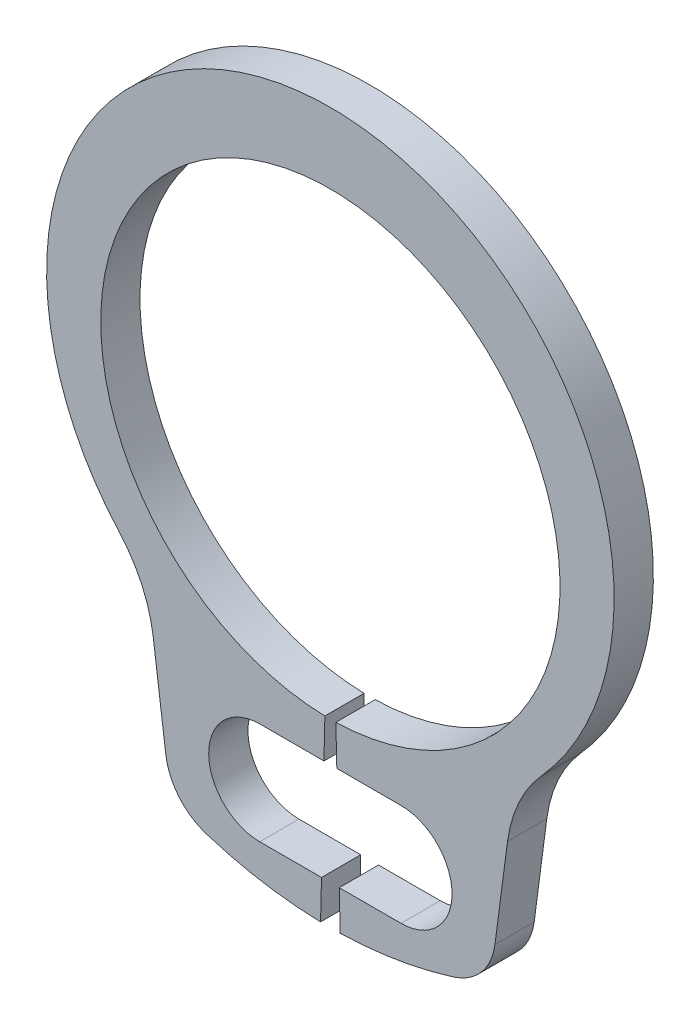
ISO-10303-21;
HEADER;
FILE_DESCRIPTION(('STEP AP214'),'2;1');
FILE_NAME('part.step','',(''),(''),'','','');
FILE_SCHEMA(('AUTOMOTIVE_DESIGN { 1 0 10303 214 1 1 1 1 }'));
ENDSEC;
DATA;
#1=APPLICATION_CONTEXT('core data for automotive mechanical design processes');
#2=APPLICATION_PROTOCOL_DEFINITION('international standard','automotive_design',2000,#1);
#3=PRODUCT_CONTEXT('',#1,'mechanical');
#4=PRODUCT('Part','Part','',(#3));
#5=PRODUCT_RELATED_PRODUCT_CATEGORY('part','',(#4));
#6=PRODUCT_DEFINITION_FORMATION('','',#4);
#7=PRODUCT_DEFINITION_CONTEXT('part definition',#1,'design');
#8=PRODUCT_DEFINITION('design','',#6,#7);
#9=PRODUCT_DEFINITION_SHAPE('','',#8);
#10=(LENGTH_UNIT() NAMED_UNIT(*) SI_UNIT(.MILLI.,.METRE.));
#11=(NAMED_UNIT(*) PLANE_ANGLE_UNIT() SI_UNIT($,.RADIAN.));
#12=(NAMED_UNIT(*) SI_UNIT($,.STERADIAN.) SOLID_ANGLE_UNIT());
#13=UNCERTAINTY_MEASURE_WITH_UNIT(LENGTH_MEASURE(1.E-05),#10,'distance_accuracy_value','');
#14=(GEOMETRIC_REPRESENTATION_CONTEXT(3) GLOBAL_UNCERTAINTY_ASSIGNED_CONTEXT((#13)) GLOBAL_UNIT_ASSIGNED_CONTEXT((#10,
#11,#12)) REPRESENTATION_CONTEXT('',''));
#15=CARTESIAN_POINT('',(0.,0.,0.));
#16=DIRECTION('',(0.,0.,1.));
#17=DIRECTION('',(1.,0.,0.));
#18=AXIS2_PLACEMENT_3D('',#15,#16,#17);
#19=CARTESIAN_POINT('',(-0.0355478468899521,-1.4854747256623,-0.254));
#20=DIRECTION('',(0.999713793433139,-0.0239234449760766,0.));
#21=DIRECTION('',(0.0239234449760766,0.999713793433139,0.));
#22=AXIS2_PLACEMENT_3D('',#19,#20,#21);
#23=PLANE('',#22);
#24=DIRECTION('',(0.,0.,1.));
#25=VECTOR('',#24,1.);
#26=CARTESIAN_POINT('',(-0.041658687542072,-1.74083475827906,-0.254));
#27=LINE('',#26,#25);
#28=CARTESIAN_POINT('',(-0.0416586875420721,-1.74083475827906,-0.254));
#29=VERTEX_POINT('',#28);
#30=CARTESIAN_POINT('',(-0.0416586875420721,-1.74083475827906,0.));
#31=VERTEX_POINT('',#30);
#32=EDGE_CURVE('E203',#29,#31,#27,.T.);
#33=ORIENTED_EDGE('',*,*,#32,.F.);
#34=DIRECTION('',(0.0239234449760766,0.999713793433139,0.));
#35=VECTOR('',#34,1.);
#36=CARTESIAN_POINT('',(-0.0355478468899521,-1.4854747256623,-0.254));
#37=LINE('',#36,#35);
#38=CARTESIAN_POINT('',(-0.0355478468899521,-1.4854747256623,-0.254));
#39=VERTEX_POINT('',#38);
#40=EDGE_CURVE('E192',#29,#39,#37,.T.);
#41=ORIENTED_EDGE('',*,*,#40,.T.);
#42=DIRECTION('',(0.,0.,1.));
#43=VECTOR('',#42,1.);
#44=CARTESIAN_POINT('',(-0.0355478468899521,-1.4854747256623,-0.254));
#45=LINE('',#44,#43);
#46=CARTESIAN_POINT('',(-0.0355478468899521,-1.4854747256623,0.));
#47=VERTEX_POINT('',#46);
#48=EDGE_CURVE('E11',#39,#47,#45,.T.);
#49=ORIENTED_EDGE('',*,*,#48,.T.);
#50=DIRECTION('',(0.0239234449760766,0.999713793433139,0.));
#51=VECTOR('',#50,1.);
#52=CARTESIAN_POINT('',(-0.0355478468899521,-1.4854747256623,0.));
#53=LINE('',#52,#51);
#54=EDGE_CURVE('E281',#31,#47,#53,.T.);
#55=ORIENTED_EDGE('',*,*,#54,.F.);
#56=EDGE_LOOP('',(#33,#41,#49,#55));
#57=FACE_BOUND('',#56,.T.);
#58=ADVANCED_FACE('F32',(#57),#23,.T.);
#59=CARTESIAN_POINT('',(0.0355478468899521,-1.4854747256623,-0.254));
#60=DIRECTION('',(-0.999713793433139,-0.0239234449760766,0.));
#61=DIRECTION('',(0.0239234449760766,-0.999713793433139,0.));
#62=AXIS2_PLACEMENT_3D('',#59,#60,#61);
#63=PLANE('',#62);
#64=DIRECTION('',(0.,0.,-1.));
#65=VECTOR('',#64,1.);
#66=CARTESIAN_POINT('',(0.041658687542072,-1.74083475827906,-0.254));
#67=LINE('',#66,#65);
#68=CARTESIAN_POINT('',(0.0416586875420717,-1.74083475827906,0.));
#69=VERTEX_POINT('',#68);
#70=CARTESIAN_POINT('',(0.0416586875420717,-1.74083475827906,-0.254));
#71=VERTEX_POINT('',#70);
#72=EDGE_CURVE('E314',#69,#71,#67,.T.);
#73=ORIENTED_EDGE('',*,*,#72,.F.);
#74=DIRECTION('',(0.0239234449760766,-0.999713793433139,0.));
#75=VECTOR('',#74,1.);
#76=CARTESIAN_POINT('',(0.0355478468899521,-1.4854747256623,0.));
#77=LINE('',#76,#75);
#78=CARTESIAN_POINT('',(0.0355478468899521,-1.4854747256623,0.));
#79=VERTEX_POINT('',#78);
#80=EDGE_CURVE('E251',#79,#69,#77,.T.);
#81=ORIENTED_EDGE('',*,*,#80,.F.);
#82=DIRECTION('',(0.,0.,1.));
#83=VECTOR('',#82,1.);
#84=CARTESIAN_POINT('',(0.0355478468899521,-1.4854747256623,-0.254));
#85=LINE('',#84,#83);
#86=CARTESIAN_POINT('',(0.0355478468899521,-1.4854747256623,-0.254));
#87=VERTEX_POINT('',#86);
#88=EDGE_CURVE('E36',#87,#79,#85,.T.);
#89=ORIENTED_EDGE('',*,*,#88,.F.);
#90=DIRECTION('',(0.0239234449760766,-0.999713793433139,0.));
#91=VECTOR('',#90,1.);
#92=CARTESIAN_POINT('',(0.0355478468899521,-1.4854747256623,-0.254));
#93=LINE('',#92,#91);
#94=EDGE_CURVE('E215',#87,#71,#93,.T.);
#95=ORIENTED_EDGE('',*,*,#94,.T.);
#96=EDGE_LOOP('',(#73,#81,#89,#95));
#97=FACE_BOUND('',#96,.T.);
#98=ADVANCED_FACE('F313',(#97),#63,.T.);
#99=CARTESIAN_POINT('',(0.,0.,-0.254));
#100=DIRECTION('',(0.,0.,1.));
#101=DIRECTION('',(1.,0.,0.));
#102=AXIS2_PLACEMENT_3D('',#99,#100,#101);
#103=CYLINDRICAL_SURFACE('',#102,1.4859);
#104=CARTESIAN_POINT('',(0.,0.,0.));
#105=DIRECTION('',(0.,0.,-1.));
#106=DIRECTION('',(1.,0.,0.));
#107=AXIS2_PLACEMENT_3D('',#104,#105,#106);
#108=CIRCLE('',#107,1.4859);
#109=EDGE_CURVE('E208',#47,#79,#108,.T.);
#110=ORIENTED_EDGE('',*,*,#109,.F.);
#111=ORIENTED_EDGE('',*,*,#48,.F.);
#112=CARTESIAN_POINT('',(0.,0.,-0.254));
#113=DIRECTION('',(0.,0.,-1.));
#114=DIRECTION('',(1.,0.,0.));
#115=AXIS2_PLACEMENT_3D('',#112,#113,#114);
#116=CIRCLE('',#115,1.4859);
#117=EDGE_CURVE('E210',#39,#87,#116,.T.);
#118=ORIENTED_EDGE('',*,*,#117,.T.);
#119=ORIENTED_EDGE('',*,*,#88,.T.);
#120=EDGE_LOOP('',(#110,#111,#118,#119));
#121=FACE_BOUND('',#120,.T.);
#122=ADVANCED_FACE('F34',(#121),#103,.F.);
#123=DIRECTION('',(0.,0.,-1.));
#124=VECTOR('',#123,1.);
#125=CARTESIAN_POINT('',(-0.0574622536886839,-2.40123475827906,-0.254));
#126=LINE('',#125,#124);
#127=CARTESIAN_POINT('',(-0.0574622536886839,-2.40123475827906,0.));
#128=VERTEX_POINT('',#127);
#129=CARTESIAN_POINT('',(-0.0574622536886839,-2.40123475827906,-0.254));
#130=VERTEX_POINT('',#129);
#131=EDGE_CURVE('E335',#128,#130,#126,.T.);
#132=ORIENTED_EDGE('',*,*,#131,.F.);
#133=CARTESIAN_POINT('',(-0.0635,-2.65354032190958,0.));
#134=VERTEX_POINT('',#133);
#135=EDGE_CURVE('E214',#134,#128,#53,.T.);
#136=ORIENTED_EDGE('',*,*,#135,.F.);
#137=DIRECTION('',(0.,0.,1.));
#138=VECTOR('',#137,1.);
#139=CARTESIAN_POINT('',(-0.0635,-2.65354032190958,-0.254));
#140=LINE('',#139,#138);
#141=CARTESIAN_POINT('',(-0.0635,-2.65354032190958,-0.254));
#142=VERTEX_POINT('',#141);
#143=EDGE_CURVE('E41',#142,#134,#140,.T.);
#144=ORIENTED_EDGE('',*,*,#143,.F.);
#145=EDGE_CURVE('E245',#142,#130,#37,.T.);
#146=ORIENTED_EDGE('',*,*,#145,.T.);
#147=EDGE_LOOP('',(#132,#136,#144,#146));
#148=FACE_BOUND('',#147,.T.);
#149=ADVANCED_FACE('F383',(#148),#23,.T.);
#150=CARTESIAN_POINT('',(0.,0.,-0.254));
#151=DIRECTION('',(0.,0.,1.));
#152=DIRECTION('',(1.,0.,0.));
#153=AXIS2_PLACEMENT_3D('',#150,#151,#152);
#154=CYLINDRICAL_SURFACE('',#153,2.6543);
#155=CARTESIAN_POINT('',(0.,0.,0.));
#156=DIRECTION('',(0.,0.,1.));
#157=DIRECTION('',(1.,0.,0.));
#158=AXIS2_PLACEMENT_3D('',#155,#156,#157);
#159=CIRCLE('',#158,2.6543);
#160=CARTESIAN_POINT('',(-0.802300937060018,-2.53014262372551,0.));
#161=VERTEX_POINT('',#160);
#162=EDGE_CURVE('E278',#161,#134,#159,.T.);
#163=ORIENTED_EDGE('',*,*,#162,.F.);
#164=DIRECTION('',(0.,0.,1.));
#165=VECTOR('',#164,1.);
#166=CARTESIAN_POINT('',(-0.802300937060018,-2.53014262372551,-0.254));
#167=LINE('',#166,#165);
#168=CARTESIAN_POINT('',(-0.802300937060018,-2.53014262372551,-0.254));
#169=VERTEX_POINT('',#168);
#170=EDGE_CURVE('E285',#169,#161,#167,.T.);
#171=ORIENTED_EDGE('',*,*,#170,.F.);
#172=CARTESIAN_POINT('',(0.,0.,-0.254));
#173=DIRECTION('',(0.,0.,1.));
#174=DIRECTION('',(1.,0.,0.));
#175=AXIS2_PLACEMENT_3D('',#172,#173,#174);
#176=CIRCLE('',#175,2.6543);
#177=EDGE_CURVE('E242',#169,#142,#176,.T.);
#178=ORIENTED_EDGE('',*,*,#177,.T.);
#179=ORIENTED_EDGE('',*,*,#143,.T.);
#180=EDGE_LOOP('',(#163,#171,#178,#179));
#181=FACE_BOUND('',#180,.T.);
#182=ADVANCED_FACE('F379',(#181),#154,.T.);
#183=CARTESIAN_POINT('',(-0.687138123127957,-2.16696425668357,-0.254));
#184=DIRECTION('',(0.,0.,1.));
#185=DIRECTION('',(1.,0.,0.));
#186=AXIS2_PLACEMENT_3D('',#183,#184,#185);
#187=CYLINDRICAL_SURFACE('',#186,0.380999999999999);
#188=CARTESIAN_POINT('',(-0.687138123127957,-2.16696425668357,0.));
#189=DIRECTION('',(0.,0.,1.));
#190=DIRECTION('',(1.,0.,0.));
#191=AXIS2_PLACEMENT_3D('',#188,#189,#190);
#192=CIRCLE('',#191,0.380999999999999);
#193=CARTESIAN_POINT('',(-1.06487861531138,-2.21669473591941,0.));
#194=VERTEX_POINT('',#193);
#195=EDGE_CURVE('E275',#194,#161,#192,.T.);
#196=ORIENTED_EDGE('',*,*,#195,.F.);
#197=DIRECTION('',(0.,0.,1.));
#198=VECTOR('',#197,1.);
#199=CARTESIAN_POINT('',(-1.06487861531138,-2.21669473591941,-0.254));
#200=LINE('',#199,#198);
#201=CARTESIAN_POINT('',(-1.06487861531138,-2.21669473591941,-0.254));
#202=VERTEX_POINT('',#201);
#203=EDGE_CURVE('E287',#202,#194,#200,.T.);
#204=ORIENTED_EDGE('',*,*,#203,.F.);
#205=CARTESIAN_POINT('',(-0.687138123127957,-2.16696425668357,-0.254));
#206=DIRECTION('',(0.,0.,1.));
#207=DIRECTION('',(1.,0.,0.));
#208=AXIS2_PLACEMENT_3D('',#205,#206,#207);
#209=CIRCLE('',#208,0.380999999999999);
#210=EDGE_CURVE('E239',#202,#169,#209,.T.);
#211=ORIENTED_EDGE('',*,*,#210,.T.);
#212=ORIENTED_EDGE('',*,*,#170,.T.);
#213=EDGE_LOOP('',(#196,#204,#211,#212));
#214=FACE_BOUND('',#213,.T.);
#215=ADVANCED_FACE('F375',(#214),#187,.T.);
#216=CARTESIAN_POINT('',(-1.14640592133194,-1.59743336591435,-0.254));
#217=DIRECTION('',(-0.99144486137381,-0.130526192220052,0.));
#218=DIRECTION('',(0.130526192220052,-0.99144486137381,0.));
#219=AXIS2_PLACEMENT_3D('',#216,#217,#218);
#220=PLANE('',#219);
#221=DIRECTION('',(0.130526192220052,-0.99144486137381,0.));
#222=VECTOR('',#221,1.);
#223=CARTESIAN_POINT('',(-1.14640592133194,-1.59743336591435,0.));
#224=LINE('',#223,#222);
#225=CARTESIAN_POINT('',(-1.14640592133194,-1.59743336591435,0.));
#226=VERTEX_POINT('',#225);
#227=EDGE_CURVE('E272',#226,#194,#224,.T.);
#228=ORIENTED_EDGE('',*,*,#227,.F.);
#229=DIRECTION('',(0.,0.,1.));
#230=VECTOR('',#229,1.);
#231=CARTESIAN_POINT('',(-1.14640592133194,-1.59743336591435,-0.254));
#232=LINE('',#231,#230);
#233=CARTESIAN_POINT('',(-1.14640592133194,-1.59743336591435,-0.254));
#234=VERTEX_POINT('',#233);
#235=EDGE_CURVE('E289',#234,#226,#232,.T.);
#236=ORIENTED_EDGE('',*,*,#235,.F.);
#237=DIRECTION('',(0.130526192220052,-0.99144486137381,0.));
#238=VECTOR('',#237,1.);
#239=CARTESIAN_POINT('',(-1.14640592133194,-1.59743336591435,-0.254));
#240=LINE('',#239,#238);
#241=EDGE_CURVE('E236',#234,#202,#240,.T.);
#242=ORIENTED_EDGE('',*,*,#241,.T.);
#243=ORIENTED_EDGE('',*,*,#203,.T.);
#244=EDGE_LOOP('',(#228,#236,#242,#243));
#245=FACE_BOUND('',#244,.T.);
#246=ADVANCED_FACE('F370',(#245),#220,.T.);
#247=CARTESIAN_POINT('',(-2.0272124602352,-1.71339374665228,-0.254));
#248=DIRECTION('',(0.,0.,1.));
#249=DIRECTION('',(1.,0.,0.));
#250=AXIS2_PLACEMENT_3D('',#247,#248,#249);
#251=CYLINDRICAL_SURFACE('',#250,0.888406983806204);
#252=CARTESIAN_POINT('',(-2.0272124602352,-1.71339374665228,0.));
#253=DIRECTION('',(0.,0.,-1.));
#254=DIRECTION('',(1.,0.,0.));
#255=AXIS2_PLACEMENT_3D('',#252,#253,#254);
#256=CIRCLE('',#255,0.888406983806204);
#257=CARTESIAN_POINT('',(-1.36619216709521,-1.11982897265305,0.));
#258=VERTEX_POINT('',#257);
#259=EDGE_CURVE('E269',#258,#226,#256,.T.);
#260=ORIENTED_EDGE('',*,*,#259,.F.);
#261=DIRECTION('',(0.,0.,1.));
#262=VECTOR('',#261,1.);
#263=CARTESIAN_POINT('',(-1.36619216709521,-1.11982897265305,-0.254));
#264=LINE('',#263,#262);
#265=CARTESIAN_POINT('',(-1.36619216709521,-1.11982897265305,-0.254));
#266=VERTEX_POINT('',#265);
#267=EDGE_CURVE('E291',#266,#258,#264,.T.);
#268=ORIENTED_EDGE('',*,*,#267,.F.);
#269=CARTESIAN_POINT('',(-2.0272124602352,-1.71339374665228,-0.254));
#270=DIRECTION('',(0.,0.,-1.));
#271=DIRECTION('',(1.,0.,0.));
#272=AXIS2_PLACEMENT_3D('',#269,#270,#271);
#273=CIRCLE('',#272,0.888406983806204);
#274=EDGE_CURVE('E233',#266,#234,#273,.T.);
#275=ORIENTED_EDGE('',*,*,#274,.T.);
#276=ORIENTED_EDGE('',*,*,#235,.T.);
#277=EDGE_LOOP('',(#260,#268,#275,#276));
#278=FACE_BOUND('',#277,.T.);
#279=ADVANCED_FACE('F366',(#278),#251,.F.);
#280=CARTESIAN_POINT('',(0.,0.106946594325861,-0.254));
#281=DIRECTION('',(0.,0.,1.));
#282=DIRECTION('',(1.,0.,0.));
#283=AXIS2_PLACEMENT_3D('',#280,#281,#282);
#284=CYLINDRICAL_SURFACE('',#283,1.83615340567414);
#285=CARTESIAN_POINT('',(0.,0.106946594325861,0.));
#286=DIRECTION('',(0.,0.,1.));
#287=DIRECTION('',(1.,0.,0.));
#288=AXIS2_PLACEMENT_3D('',#285,#286,#287);
#289=CIRCLE('',#288,1.83615340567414);
#290=CARTESIAN_POINT('',(1.36619216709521,-1.11982897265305,0.));
#291=VERTEX_POINT('',#290);
#292=EDGE_CURVE('E266',#291,#258,#289,.T.);
#293=ORIENTED_EDGE('',*,*,#292,.F.);
#294=DIRECTION('',(0.,0.,1.));
#295=VECTOR('',#294,1.);
#296=CARTESIAN_POINT('',(1.36619216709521,-1.11982897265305,-0.254));
#297=LINE('',#296,#295);
#298=CARTESIAN_POINT('',(1.36619216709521,-1.11982897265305,-0.254));
#299=VERTEX_POINT('',#298);
#300=EDGE_CURVE('E293',#299,#291,#297,.T.);
#301=ORIENTED_EDGE('',*,*,#300,.F.);
#302=CARTESIAN_POINT('',(0.,0.106946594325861,-0.254));
#303=DIRECTION('',(0.,0.,1.));
#304=DIRECTION('',(1.,0.,0.));
#305=AXIS2_PLACEMENT_3D('',#302,#303,#304);
#306=CIRCLE('',#305,1.83615340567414);
#307=EDGE_CURVE('E230',#299,#266,#306,.T.);
#308=ORIENTED_EDGE('',*,*,#307,.T.);
#309=ORIENTED_EDGE('',*,*,#267,.T.);
#310=EDGE_LOOP('',(#293,#301,#308,#309));
#311=FACE_BOUND('',#310,.T.);
#312=ADVANCED_FACE('F362',(#311),#284,.T.);
#313=CARTESIAN_POINT('',(2.0272124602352,-1.71339374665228,-0.254));
#314=DIRECTION('',(0.,0.,1.));
#315=DIRECTION('',(1.,0.,0.));
#316=AXIS2_PLACEMENT_3D('',#313,#314,#315);
#317=CYLINDRICAL_SURFACE('',#316,0.888406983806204);
#318=CARTESIAN_POINT('',(2.0272124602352,-1.71339374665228,0.));
#319=DIRECTION('',(0.,0.,-1.));
#320=DIRECTION('',(1.,0.,0.));
#321=AXIS2_PLACEMENT_3D('',#318,#319,#320);
#322=CIRCLE('',#321,0.888406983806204);
#323=CARTESIAN_POINT('',(1.14640592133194,-1.59743336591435,0.));
#324=VERTEX_POINT('',#323);
#325=EDGE_CURVE('E263',#324,#291,#322,.T.);
#326=ORIENTED_EDGE('',*,*,#325,.F.);
#327=DIRECTION('',(0.,0.,1.));
#328=VECTOR('',#327,1.);
#329=CARTESIAN_POINT('',(1.14640592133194,-1.59743336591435,-0.254));
#330=LINE('',#329,#328);
#331=CARTESIAN_POINT('',(1.14640592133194,-1.59743336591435,-0.254));
#332=VERTEX_POINT('',#331);
#333=EDGE_CURVE('E295',#332,#324,#330,.T.);
#334=ORIENTED_EDGE('',*,*,#333,.F.);
#335=CARTESIAN_POINT('',(2.0272124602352,-1.71339374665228,-0.254));
#336=DIRECTION('',(0.,0.,-1.));
#337=DIRECTION('',(1.,0.,0.));
#338=AXIS2_PLACEMENT_3D('',#335,#336,#337);
#339=CIRCLE('',#338,0.888406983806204);
#340=EDGE_CURVE('E227',#332,#299,#339,.T.);
#341=ORIENTED_EDGE('',*,*,#340,.T.);
#342=ORIENTED_EDGE('',*,*,#300,.T.);
#343=EDGE_LOOP('',(#326,#334,#341,#342));
#344=FACE_BOUND('',#343,.T.);
#345=ADVANCED_FACE('F358',(#344),#317,.F.);
#346=CARTESIAN_POINT('',(1.14640592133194,-1.59743336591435,-0.254));
#347=DIRECTION('',(0.99144486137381,-0.130526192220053,0.));
#348=DIRECTION('',(0.130526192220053,0.99144486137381,0.));
#349=AXIS2_PLACEMENT_3D('',#346,#347,#348);
#350=PLANE('',#349);
#351=DIRECTION('',(0.130526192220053,0.99144486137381,0.));
#352=VECTOR('',#351,1.);
#353=CARTESIAN_POINT('',(1.14640592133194,-1.59743336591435,0.));
#354=LINE('',#353,#352);
#355=CARTESIAN_POINT('',(1.06487861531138,-2.21669473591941,0.));
#356=VERTEX_POINT('',#355);
#357=EDGE_CURVE('E260',#356,#324,#354,.T.);
#358=ORIENTED_EDGE('',*,*,#357,.F.);
#359=DIRECTION('',(0.,0.,1.));
#360=VECTOR('',#359,1.);
#361=CARTESIAN_POINT('',(1.06487861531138,-2.21669473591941,-0.254));
#362=LINE('',#361,#360);
#363=CARTESIAN_POINT('',(1.06487861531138,-2.21669473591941,-0.254));
#364=VERTEX_POINT('',#363);
#365=EDGE_CURVE('E297',#364,#356,#362,.T.);
#366=ORIENTED_EDGE('',*,*,#365,.F.);
#367=DIRECTION('',(0.130526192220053,0.99144486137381,0.));
#368=VECTOR('',#367,1.);
#369=CARTESIAN_POINT('',(1.14640592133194,-1.59743336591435,-0.254));
#370=LINE('',#369,#368);
#371=EDGE_CURVE('E224',#364,#332,#370,.T.);
#372=ORIENTED_EDGE('',*,*,#371,.T.);
#373=ORIENTED_EDGE('',*,*,#333,.T.);
#374=EDGE_LOOP('',(#358,#366,#372,#373));
#375=FACE_BOUND('',#374,.T.);
#376=ADVANCED_FACE('F354',(#375),#350,.T.);
#377=CARTESIAN_POINT('',(0.687138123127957,-2.16696425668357,-0.254));
#378=DIRECTION('',(0.,0.,1.));
#379=DIRECTION('',(1.,0.,0.));
#380=AXIS2_PLACEMENT_3D('',#377,#378,#379);
#381=CYLINDRICAL_SURFACE('',#380,0.380999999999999);
#382=CARTESIAN_POINT('',(0.687138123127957,-2.16696425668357,0.));
#383=DIRECTION('',(0.,0.,1.));
#384=DIRECTION('',(-1.,0.,0.));
#385=AXIS2_PLACEMENT_3D('',#382,#383,#384);
#386=CIRCLE('',#385,0.380999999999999);
#387=CARTESIAN_POINT('',(0.802300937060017,-2.53014262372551,0.));
#388=VERTEX_POINT('',#387);
#389=EDGE_CURVE('E257',#388,#356,#386,.T.);
#390=ORIENTED_EDGE('',*,*,#389,.F.);
#391=DIRECTION('',(0.,0.,1.));
#392=VECTOR('',#391,1.);
#393=CARTESIAN_POINT('',(0.802300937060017,-2.53014262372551,-0.254));
#394=LINE('',#393,#392);
#395=CARTESIAN_POINT('',(0.802300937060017,-2.53014262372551,-0.254));
#396=VERTEX_POINT('',#395);
#397=EDGE_CURVE('E299',#396,#388,#394,.T.);
#398=ORIENTED_EDGE('',*,*,#397,.F.);
#399=CARTESIAN_POINT('',(0.687138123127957,-2.16696425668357,-0.254));
#400=DIRECTION('',(0.,0.,1.));
#401=DIRECTION('',(-1.,0.,0.));
#402=AXIS2_PLACEMENT_3D('',#399,#400,#401);
#403=CIRCLE('',#402,0.380999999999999);
#404=EDGE_CURVE('E221',#396,#364,#403,.T.);
#405=ORIENTED_EDGE('',*,*,#404,.T.);
#406=ORIENTED_EDGE('',*,*,#365,.T.);
#407=EDGE_LOOP('',(#390,#398,#405,#406));
#408=FACE_BOUND('',#407,.T.);
#409=ADVANCED_FACE('F351',(#408),#381,.T.);
#410=CARTESIAN_POINT('',(0.,0.,-0.254));
#411=DIRECTION('',(0.,0.,1.));
#412=DIRECTION('',(1.,0.,0.));
#413=AXIS2_PLACEMENT_3D('',#410,#411,#412);
#414=CYLINDRICAL_SURFACE('',#413,2.6543);
#415=CARTESIAN_POINT('',(0.,0.,0.));
#416=DIRECTION('',(0.,0.,1.));
#417=DIRECTION('',(1.,0.,0.));
#418=AXIS2_PLACEMENT_3D('',#415,#416,#417);
#419=CIRCLE('',#418,2.6543);
#420=CARTESIAN_POINT('',(0.0635000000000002,-2.65354032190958,0.));
#421=VERTEX_POINT('',#420);
#422=EDGE_CURVE('E254',#421,#388,#419,.T.);
#423=ORIENTED_EDGE('',*,*,#422,.F.);
#424=DIRECTION('',(0.,0.,1.));
#425=VECTOR('',#424,1.);
#426=CARTESIAN_POINT('',(0.0635000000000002,-2.65354032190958,-0.254));
#427=LINE('',#426,#425);
#428=CARTESIAN_POINT('',(0.0635000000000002,-2.65354032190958,-0.254));
#429=VERTEX_POINT('',#428);
#430=EDGE_CURVE('E300',#429,#421,#427,.T.);
#431=ORIENTED_EDGE('',*,*,#430,.F.);
#432=CARTESIAN_POINT('',(0.,0.,-0.254));
#433=DIRECTION('',(0.,0.,1.));
#434=DIRECTION('',(1.,0.,0.));
#435=AXIS2_PLACEMENT_3D('',#432,#433,#434);
#436=CIRCLE('',#435,2.6543);
#437=EDGE_CURVE('E218',#429,#396,#436,.T.);
#438=ORIENTED_EDGE('',*,*,#437,.T.);
#439=ORIENTED_EDGE('',*,*,#397,.T.);
#440=EDGE_LOOP('',(#423,#431,#438,#439));
#441=FACE_BOUND('',#440,.T.);
#442=ADVANCED_FACE('F347',(#441),#414,.T.);
#443=DIRECTION('',(0.,0.,1.));
#444=VECTOR('',#443,1.);
#445=CARTESIAN_POINT('',(0.0574622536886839,-2.40123475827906,-0.254));
#446=LINE('',#445,#444);
#447=CARTESIAN_POINT('',(0.0574622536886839,-2.40123475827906,-0.254));
#448=VERTEX_POINT('',#447);
#449=CARTESIAN_POINT('',(0.0574622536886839,-2.40123475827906,0.));
#450=VERTEX_POINT('',#449);
#451=EDGE_CURVE('E330',#448,#450,#446,.T.);
#452=ORIENTED_EDGE('',*,*,#451,.F.);
#453=EDGE_CURVE('E213',#448,#429,#93,.T.);
#454=ORIENTED_EDGE('',*,*,#453,.T.);
#455=ORIENTED_EDGE('',*,*,#430,.T.);
#456=EDGE_CURVE('E250',#450,#421,#77,.T.);
#457=ORIENTED_EDGE('',*,*,#456,.F.);
#458=EDGE_LOOP('',(#452,#454,#455,#457));
#459=FACE_BOUND('',#458,.T.);
#460=ADVANCED_FACE('F345',(#459),#63,.T.);
#461=CARTESIAN_POINT('',(0.,0.,-0.254));
#462=DIRECTION('',(0.,0.,1.));
#463=DIRECTION('',(1.,0.,0.));
#464=AXIS2_PLACEMENT_3D('',#461,#462,#463);
#465=PLANE('',#464);
#466=CARTESIAN_POINT('',(0.4572,-2.07103475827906,-0.254));
#467=DIRECTION('',(0.,0.,1.));
#468=DIRECTION('',(1.,0.,0.));
#469=AXIS2_PLACEMENT_3D('',#466,#467,#468);
#470=CIRCLE('',#469,0.3302);
#471=CARTESIAN_POINT('',(0.4572,-2.40123475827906,-0.254));
#472=VERTEX_POINT('',#471);
#473=CARTESIAN_POINT('',(0.4572,-1.74083475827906,-0.254));
#474=VERTEX_POINT('',#473);
#475=EDGE_CURVE('E201',#472,#474,#470,.T.);
#476=ORIENTED_EDGE('',*,*,#475,.T.);
#477=DIRECTION('',(-1.,0.,0.));
#478=VECTOR('',#477,1.);
#479=CARTESIAN_POINT('',(-0.4572,-1.74083475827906,-0.254));
#480=LINE('',#479,#478);
#481=EDGE_CURVE('E57',#474,#71,#480,.T.);
#482=ORIENTED_EDGE('',*,*,#481,.T.);
#483=ORIENTED_EDGE('',*,*,#94,.F.);
#484=ORIENTED_EDGE('',*,*,#117,.F.);
#485=ORIENTED_EDGE('',*,*,#40,.F.);
#486=CARTESIAN_POINT('',(-0.4572,-1.74083475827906,-0.254));
#487=VERTEX_POINT('',#486);
#488=EDGE_CURVE('E173',#29,#487,#480,.T.);
#489=ORIENTED_EDGE('',*,*,#488,.T.);
#490=CARTESIAN_POINT('',(-0.4572,-2.07103475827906,-0.254));
#491=DIRECTION('',(0.,0.,1.));
#492=DIRECTION('',(1.,0.,0.));
#493=AXIS2_PLACEMENT_3D('',#490,#491,#492);
#494=CIRCLE('',#493,0.3302);
#495=CARTESIAN_POINT('',(-0.4572,-2.40123475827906,-0.254));
#496=VERTEX_POINT('',#495);
#497=EDGE_CURVE('E190',#487,#496,#494,.T.);
#498=ORIENTED_EDGE('',*,*,#497,.T.);
#499=DIRECTION('',(1.,0.,0.));
#500=VECTOR('',#499,1.);
#501=CARTESIAN_POINT('',(0.4572,-2.40123475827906,-0.254));
#502=LINE('',#501,#500);
#503=EDGE_CURVE('E182',#496,#130,#502,.T.);
#504=ORIENTED_EDGE('',*,*,#503,.T.);
#505=ORIENTED_EDGE('',*,*,#145,.F.);
#506=ORIENTED_EDGE('',*,*,#177,.F.);
#507=ORIENTED_EDGE('',*,*,#210,.F.);
#508=ORIENTED_EDGE('',*,*,#241,.F.);
#509=ORIENTED_EDGE('',*,*,#274,.F.);
#510=ORIENTED_EDGE('',*,*,#307,.F.);
#511=ORIENTED_EDGE('',*,*,#340,.F.);
#512=ORIENTED_EDGE('',*,*,#371,.F.);
#513=ORIENTED_EDGE('',*,*,#404,.F.);
#514=ORIENTED_EDGE('',*,*,#437,.F.);
#515=ORIENTED_EDGE('',*,*,#453,.F.);
#516=EDGE_CURVE('E322',#448,#472,#502,.T.);
#517=ORIENTED_EDGE('',*,*,#516,.T.);
#518=EDGE_LOOP('',(#476,#482,#483,#484,#485,#489,#498,#504,#505,#506,#507,#508,#509,#510,#511,
#512,#513,#514,#515,#517));
#519=FACE_BOUND('',#518,.T.);
#520=ADVANCED_FACE('F188',(#519),#465,.F.);
#521=CARTESIAN_POINT('',(0.,0.,0.));
#522=DIRECTION('',(0.,0.,1.));
#523=DIRECTION('',(1.,0.,0.));
#524=AXIS2_PLACEMENT_3D('',#521,#522,#523);
#525=PLANE('',#524);
#526=DIRECTION('',(-1.,0.,0.));
#527=VECTOR('',#526,1.);
#528=CARTESIAN_POINT('',(-0.4572,-1.74083475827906,0.));
#529=LINE('',#528,#527);
#530=CARTESIAN_POINT('',(0.4572,-1.74083475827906,0.));
#531=VERTEX_POINT('',#530);
#532=EDGE_CURVE('E325',#531,#69,#529,.T.);
#533=ORIENTED_EDGE('',*,*,#532,.F.);
#534=CARTESIAN_POINT('',(0.4572,-2.07103475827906,0.));
#535=DIRECTION('',(0.,0.,1.));
#536=DIRECTION('',(1.,0.,0.));
#537=AXIS2_PLACEMENT_3D('',#534,#535,#536);
#538=CIRCLE('',#537,0.3302);
#539=CARTESIAN_POINT('',(0.4572,-2.40123475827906,0.));
#540=VERTEX_POINT('',#539);
#541=EDGE_CURVE('E197',#540,#531,#538,.T.);
#542=ORIENTED_EDGE('',*,*,#541,.F.);
#543=DIRECTION('',(1.,0.,0.));
#544=VECTOR('',#543,1.);
#545=CARTESIAN_POINT('',(0.4572,-2.40123475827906,0.));
#546=LINE('',#545,#544);
#547=EDGE_CURVE('E49',#450,#540,#546,.T.);
#548=ORIENTED_EDGE('',*,*,#547,.F.);
#549=ORIENTED_EDGE('',*,*,#456,.T.);
#550=ORIENTED_EDGE('',*,*,#422,.T.);
#551=ORIENTED_EDGE('',*,*,#389,.T.);
#552=ORIENTED_EDGE('',*,*,#357,.T.);
#553=ORIENTED_EDGE('',*,*,#325,.T.);
#554=ORIENTED_EDGE('',*,*,#292,.T.);
#555=ORIENTED_EDGE('',*,*,#259,.T.);
#556=ORIENTED_EDGE('',*,*,#227,.T.);
#557=ORIENTED_EDGE('',*,*,#195,.T.);
#558=ORIENTED_EDGE('',*,*,#162,.T.);
#559=ORIENTED_EDGE('',*,*,#135,.T.);
#560=CARTESIAN_POINT('',(-0.4572,-2.40123475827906,0.));
#561=VERTEX_POINT('',#560);
#562=EDGE_CURVE('E193',#561,#128,#546,.T.);
#563=ORIENTED_EDGE('',*,*,#562,.F.);
#564=CARTESIAN_POINT('',(-0.4572,-2.07103475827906,0.));
#565=DIRECTION('',(0.,0.,1.));
#566=DIRECTION('',(1.,0.,0.));
#567=AXIS2_PLACEMENT_3D('',#564,#565,#566);
#568=CIRCLE('',#567,0.3302);
#569=CARTESIAN_POINT('',(-0.4572,-1.74083475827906,0.));
#570=VERTEX_POINT('',#569);
#571=EDGE_CURVE('E198',#570,#561,#568,.T.);
#572=ORIENTED_EDGE('',*,*,#571,.F.);
#573=EDGE_CURVE('E176',#31,#570,#529,.T.);
#574=ORIENTED_EDGE('',*,*,#573,.F.);
#575=ORIENTED_EDGE('',*,*,#54,.T.);
#576=ORIENTED_EDGE('',*,*,#109,.T.);
#577=ORIENTED_EDGE('',*,*,#80,.T.);
#578=EDGE_LOOP('',(#533,#542,#548,#549,#550,#551,#552,#553,#554,#555,#556,#557,#558,#559,#563,
#572,#574,#575,#576,#577));
#579=FACE_BOUND('',#578,.T.);
#580=ADVANCED_FACE('F317',(#579),#525,.T.);
#581=CARTESIAN_POINT('',(0.4572,-2.07103475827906,-0.254));
#582=DIRECTION('',(0.,0.,1.));
#583=DIRECTION('',(1.,0.,0.));
#584=AXIS2_PLACEMENT_3D('',#581,#582,#583);
#585=CYLINDRICAL_SURFACE('',#584,0.3302);
#586=ORIENTED_EDGE('',*,*,#541,.T.);
#587=DIRECTION('',(0.,0.,1.));
#588=VECTOR('',#587,1.);
#589=CARTESIAN_POINT('',(0.4572,-1.74083475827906,-0.254));
#590=LINE('',#589,#588);
#591=EDGE_CURVE('E328',#474,#531,#590,.T.);
#592=ORIENTED_EDGE('',*,*,#591,.F.);
#593=ORIENTED_EDGE('',*,*,#475,.F.);
#594=DIRECTION('',(0.,0.,1.));
#595=VECTOR('',#594,1.);
#596=CARTESIAN_POINT('',(0.4572,-2.40123475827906,-0.254));
#597=LINE('',#596,#595);
#598=EDGE_CURVE('E331',#472,#540,#597,.T.);
#599=ORIENTED_EDGE('',*,*,#598,.T.);
#600=EDGE_LOOP('',(#586,#592,#593,#599));
#601=FACE_BOUND('',#600,.T.);
#602=ADVANCED_FACE('F339',(#601),#585,.F.);
#603=CARTESIAN_POINT('',(-0.4572,-2.07103475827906,-0.254));
#604=DIRECTION('',(0.,0.,1.));
#605=DIRECTION('',(1.,0.,0.));
#606=AXIS2_PLACEMENT_3D('',#603,#604,#605);
#607=CYLINDRICAL_SURFACE('',#606,0.3302);
#608=ORIENTED_EDGE('',*,*,#571,.T.);
#609=DIRECTION('',(0.,0.,1.));
#610=VECTOR('',#609,1.);
#611=CARTESIAN_POINT('',(-0.4572,-2.40123475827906,-0.254));
#612=LINE('',#611,#610);
#613=EDGE_CURVE('E181',#496,#561,#612,.T.);
#614=ORIENTED_EDGE('',*,*,#613,.F.);
#615=ORIENTED_EDGE('',*,*,#497,.F.);
#616=DIRECTION('',(0.,0.,1.));
#617=VECTOR('',#616,1.);
#618=CARTESIAN_POINT('',(-0.4572,-1.74083475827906,-0.254));
#619=LINE('',#618,#617);
#620=EDGE_CURVE('E170',#487,#570,#619,.T.);
#621=ORIENTED_EDGE('',*,*,#620,.T.);
#622=EDGE_LOOP('',(#608,#614,#615,#621));
#623=FACE_BOUND('',#622,.T.);
#624=ADVANCED_FACE('F196',(#623),#607,.F.);
#625=CARTESIAN_POINT('',(-0.4572,-1.74083475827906,-0.254));
#626=DIRECTION('',(0.,1.,0.));
#627=DIRECTION('',(-1.,0.,0.));
#628=AXIS2_PLACEMENT_3D('',#625,#626,#627);
#629=PLANE('',#628);
#630=ORIENTED_EDGE('',*,*,#32,.T.);
#631=ORIENTED_EDGE('',*,*,#573,.T.);
#632=ORIENTED_EDGE('',*,*,#620,.F.);
#633=ORIENTED_EDGE('',*,*,#488,.F.);
#634=EDGE_LOOP('',(#630,#631,#632,#633));
#635=FACE_BOUND('',#634,.T.);
#636=ADVANCED_FACE('F172',(#635),#629,.F.);
#637=CARTESIAN_POINT('',(0.4572,-2.40123475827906,-0.254));
#638=DIRECTION('',(0.,-1.,0.));
#639=DIRECTION('',(0.,0.,-1.));
#640=AXIS2_PLACEMENT_3D('',#637,#638,#639);
#641=PLANE('',#640);
#642=ORIENTED_EDGE('',*,*,#131,.T.);
#643=ORIENTED_EDGE('',*,*,#503,.F.);
#644=ORIENTED_EDGE('',*,*,#613,.T.);
#645=ORIENTED_EDGE('',*,*,#562,.T.);
#646=EDGE_LOOP('',(#642,#643,#644,#645));
#647=FACE_BOUND('',#646,.T.);
#648=ADVANCED_FACE('F386',(#647),#641,.F.);
#649=ORIENTED_EDGE('',*,*,#451,.T.);
#650=ORIENTED_EDGE('',*,*,#547,.T.);
#651=ORIENTED_EDGE('',*,*,#598,.F.);
#652=ORIENTED_EDGE('',*,*,#516,.F.);
#653=EDGE_LOOP('',(#649,#650,#651,#652));
#654=FACE_BOUND('',#653,.T.);
#655=ADVANCED_FACE('F340',(#654),#641,.F.);
#656=ORIENTED_EDGE('',*,*,#72,.T.);
#657=ORIENTED_EDGE('',*,*,#481,.F.);
#658=ORIENTED_EDGE('',*,*,#591,.T.);
#659=ORIENTED_EDGE('',*,*,#532,.T.);
#660=EDGE_LOOP('',(#656,#657,#658,#659));
#661=FACE_BOUND('',#660,.T.);
#662=ADVANCED_FACE('F336',(#661),#629,.F.);
#663=CLOSED_SHELL('',(#58,#98,#122,#149,#182,#215,#246,#279,#312,#345,#376,#409,#442,#460,#520,
#580,#602,#624,#636,#648,#655,#662));
#664=MANIFOLD_SOLID_BREP('B2',#663);
#665=ADVANCED_BREP_SHAPE_REPRESENTATION('',(#18,#664),#14);
#666=SHAPE_DEFINITION_REPRESENTATION(#9,#665);
ENDSEC;
END-ISO-10303-21;
